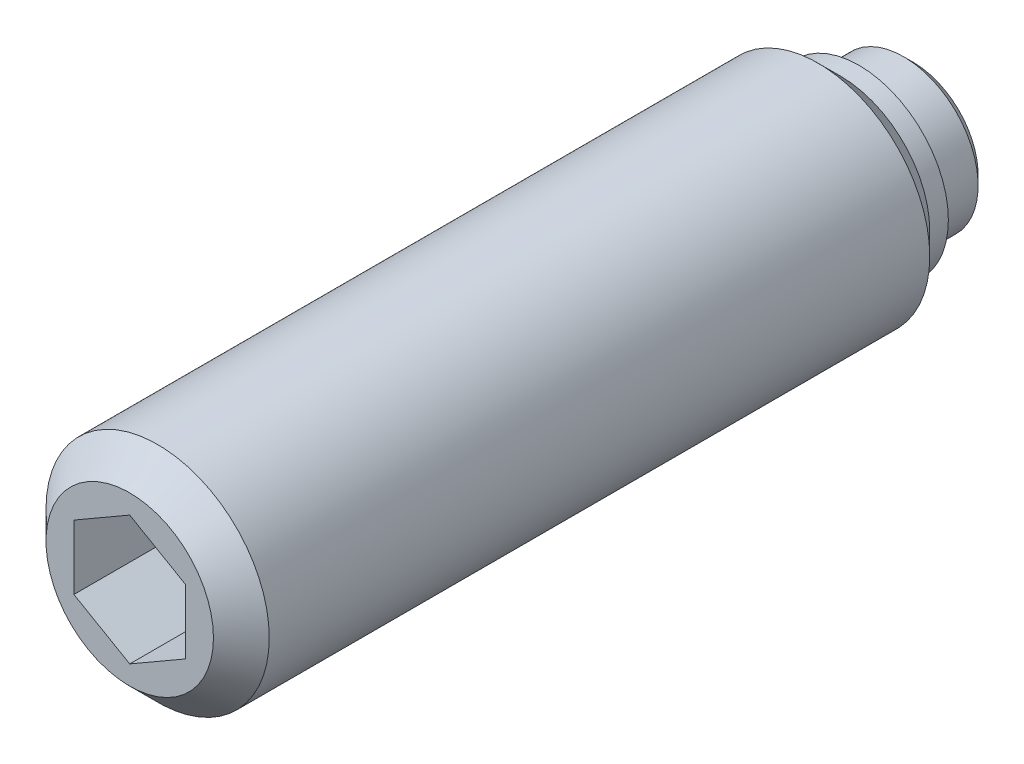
ISO-10303-21;
HEADER;
FILE_DESCRIPTION(('STEP AP214'),'2;1');
FILE_NAME('part.step','',(''),(''),'','','');
FILE_SCHEMA(('AUTOMOTIVE_DESIGN { 1 0 10303 214 1 1 1 1 }'));
ENDSEC;
DATA;
#1=APPLICATION_CONTEXT('core data for automotive mechanical design processes');
#2=APPLICATION_PROTOCOL_DEFINITION('international standard','automotive_design',2000,#1);
#3=PRODUCT_CONTEXT('',#1,'mechanical');
#4=PRODUCT('Part','Part','',(#3));
#5=PRODUCT_RELATED_PRODUCT_CATEGORY('part','',(#4));
#6=PRODUCT_DEFINITION_FORMATION('','',#4);
#7=PRODUCT_DEFINITION_CONTEXT('part definition',#1,'design');
#8=PRODUCT_DEFINITION('design','',#6,#7);
#9=PRODUCT_DEFINITION_SHAPE('','',#8);
#10=(LENGTH_UNIT() NAMED_UNIT(*) SI_UNIT(.MILLI.,.METRE.));
#11=(NAMED_UNIT(*) PLANE_ANGLE_UNIT() SI_UNIT($,.RADIAN.));
#12=(NAMED_UNIT(*) SI_UNIT($,.STERADIAN.) SOLID_ANGLE_UNIT());
#13=UNCERTAINTY_MEASURE_WITH_UNIT(LENGTH_MEASURE(1.E-05),#10,'distance_accuracy_value','');
#14=(GEOMETRIC_REPRESENTATION_CONTEXT(3) GLOBAL_UNCERTAINTY_ASSIGNED_CONTEXT((#13)) GLOBAL_UNIT_ASSIGNED_CONTEXT((#10,
#11,#12)) REPRESENTATION_CONTEXT('',''));
#15=CARTESIAN_POINT('',(0.,0.,0.));
#16=DIRECTION('',(0.,0.,1.));
#17=DIRECTION('',(1.,0.,0.));
#18=AXIS2_PLACEMENT_3D('',#15,#16,#17);
#19=CARTESIAN_POINT('',(0.,0.,0.));
#20=DIRECTION('',(0.,0.,-1.));
#21=DIRECTION('',(-1.,0.,0.));
#22=AXIS2_PLACEMENT_3D('',#19,#20,#21);
#23=CYLINDRICAL_SURFACE('',#22,4.);
#24=CARTESIAN_POINT('',(0.,0.,0.5));
#25=DIRECTION('',(0.,0.,-1.));
#26=DIRECTION('',(-1.,0.,0.));
#27=AXIS2_PLACEMENT_3D('',#24,#25,#26);
#28=CIRCLE('',#27,4.);
#29=CARTESIAN_POINT('',(-4.,0.,0.5));
#30=VERTEX_POINT('',#29);
#31=EDGE_CURVE('E133',#30,#30,#28,.T.);
#32=ORIENTED_EDGE('',*,*,#31,.F.);
#33=EDGE_LOOP('',(#32));
#34=FACE_BOUND('',#33,.T.);
#35=CARTESIAN_POINT('',(0.,0.,2.9));
#36=DIRECTION('',(0.,0.,-1.));
#37=DIRECTION('',(-1.,0.,0.));
#38=AXIS2_PLACEMENT_3D('',#35,#36,#37);
#39=CIRCLE('',#38,4.);
#40=CARTESIAN_POINT('',(-4.,0.,2.9));
#41=VERTEX_POINT('',#40);
#42=EDGE_CURVE('E127',#41,#41,#39,.T.);
#43=ORIENTED_EDGE('',*,*,#42,.T.);
#44=EDGE_LOOP('',(#43));
#45=FACE_BOUND('',#44,.T.);
#46=ADVANCED_FACE('F14',(#34,#45),#23,.T.);
#47=CARTESIAN_POINT('',(0.,0.,0.5));
#48=DIRECTION('',(0.,0.,1.));
#49=DIRECTION('',(1.,0.,0.));
#50=AXIS2_PLACEMENT_3D('',#47,#48,#49);
#51=CONICAL_SURFACE('',#50,4.,0.785398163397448);
#52=CARTESIAN_POINT('',(0.,0.,0.));
#53=DIRECTION('',(0.,0.,-1.));
#54=DIRECTION('',(-1.,0.,0.));
#55=AXIS2_PLACEMENT_3D('',#52,#53,#54);
#56=CIRCLE('',#55,3.5);
#57=CARTESIAN_POINT('',(-3.5,0.,0.));
#58=VERTEX_POINT('',#57);
#59=EDGE_CURVE('E130',#58,#58,#56,.T.);
#60=ORIENTED_EDGE('',*,*,#59,.F.);
#61=EDGE_LOOP('',(#60));
#62=FACE_BOUND('',#61,.T.);
#63=ORIENTED_EDGE('',*,*,#31,.T.);
#64=EDGE_LOOP('',(#63));
#65=FACE_BOUND('',#64,.T.);
#66=ADVANCED_FACE('F159',(#62,#65),#51,.T.);
#67=CARTESIAN_POINT('',(0.,3.5,0.));
#68=DIRECTION('',(0.,0.,1.));
#69=DIRECTION('',(1.,0.,0.));
#70=AXIS2_PLACEMENT_3D('',#67,#68,#69);
#71=PLANE('',#70);
#72=ORIENTED_EDGE('',*,*,#59,.T.);
#73=EDGE_LOOP('',(#72));
#74=FACE_BOUND('',#73,.T.);
#75=ADVANCED_FACE('F165',(#74),#71,.F.);
#76=CARTESIAN_POINT('',(0.,0.,2.9));
#77=DIRECTION('',(0.,0.,-1.));
#78=DIRECTION('',(-1.,0.,0.));
#79=AXIS2_PLACEMENT_3D('',#76,#77,#78);
#80=CYLINDRICAL_SURFACE('',#79,6.);
#81=CARTESIAN_POINT('',(0.,0.,5.1));
#82=DIRECTION('',(0.,0.,-1.));
#83=DIRECTION('',(-1.,0.,0.));
#84=AXIS2_PLACEMENT_3D('',#81,#82,#83);
#85=CIRCLE('',#84,6.);
#86=CARTESIAN_POINT('',(-6.,0.,5.1));
#87=VERTEX_POINT('',#86);
#88=EDGE_CURVE('E9',#87,#87,#85,.T.);
#89=ORIENTED_EDGE('',*,*,#88,.F.);
#90=EDGE_LOOP('',(#89));
#91=FACE_BOUND('',#90,.T.);
#92=CARTESIAN_POINT('',(0.,0.,40.6));
#93=DIRECTION('',(0.,0.,1.));
#94=DIRECTION('',(1.,0.,0.));
#95=AXIS2_PLACEMENT_3D('',#92,#93,#94);
#96=CIRCLE('',#95,6.);
#97=CARTESIAN_POINT('',(6.,0.,40.6));
#98=VERTEX_POINT('',#97);
#99=EDGE_CURVE('E124',#98,#98,#96,.T.);
#100=ORIENTED_EDGE('',*,*,#99,.F.);
#101=EDGE_LOOP('',(#100));
#102=FACE_BOUND('',#101,.T.);
#103=ADVANCED_FACE('F16',(#91,#102),#80,.T.);
#104=CARTESIAN_POINT('',(0.,4.8,2.9));
#105=DIRECTION('',(0.,0.,1.));
#106=DIRECTION('',(1.,0.,0.));
#107=AXIS2_PLACEMENT_3D('',#104,#105,#106);
#108=PLANE('',#107);
#109=CARTESIAN_POINT('',(0.,0.,2.9));
#110=DIRECTION('',(0.,0.,-1.));
#111=DIRECTION('',(-1.,0.,0.));
#112=AXIS2_PLACEMENT_3D('',#109,#110,#111);
#113=CIRCLE('',#112,4.8);
#114=CARTESIAN_POINT('',(-4.8,0.,2.9));
#115=VERTEX_POINT('',#114);
#116=EDGE_CURVE('E136',#115,#115,#113,.T.);
#117=ORIENTED_EDGE('',*,*,#116,.T.);
#118=EDGE_LOOP('',(#117));
#119=FACE_BOUND('',#118,.T.);
#120=ORIENTED_EDGE('',*,*,#42,.F.);
#121=EDGE_LOOP('',(#120));
#122=FACE_BOUND('',#121,.T.);
#123=ADVANCED_FACE('F156',(#119,#122),#108,.F.);
#124=CARTESIAN_POINT('',(0.,0.,2.9));
#125=DIRECTION('',(0.,0.,-1.));
#126=DIRECTION('',(-1.,0.,0.));
#127=AXIS2_PLACEMENT_3D('',#124,#125,#126);
#128=CYLINDRICAL_SURFACE('',#127,4.8);
#129=CARTESIAN_POINT('',(0.,0.,3.9));
#130=DIRECTION('',(0.,0.,-1.));
#131=DIRECTION('',(-1.,0.,0.));
#132=AXIS2_PLACEMENT_3D('',#129,#130,#131);
#133=CIRCLE('',#132,4.8);
#134=CARTESIAN_POINT('',(-4.8,0.,3.9));
#135=VERTEX_POINT('',#134);
#136=EDGE_CURVE('E22',#135,#135,#133,.T.);
#137=ORIENTED_EDGE('',*,*,#136,.T.);
#138=EDGE_LOOP('',(#137));
#139=FACE_BOUND('',#138,.T.);
#140=ORIENTED_EDGE('',*,*,#116,.F.);
#141=EDGE_LOOP('',(#140));
#142=FACE_BOUND('',#141,.T.);
#143=ADVANCED_FACE('F141',(#139,#142),#128,.T.);
#144=CARTESIAN_POINT('',(0.,0.,5.1));
#145=DIRECTION('',(0.,0.,1.));
#146=DIRECTION('',(1.,0.,0.));
#147=AXIS2_PLACEMENT_3D('',#144,#145,#146);
#148=CONICAL_SURFACE('',#147,6.,0.785398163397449);
#149=ORIENTED_EDGE('',*,*,#88,.T.);
#150=EDGE_LOOP('',(#149));
#151=FACE_BOUND('',#150,.T.);
#152=ORIENTED_EDGE('',*,*,#136,.F.);
#153=EDGE_LOOP('',(#152));
#154=FACE_BOUND('',#153,.T.);
#155=ADVANCED_FACE('F144',(#151,#154),#148,.T.);
#156=CARTESIAN_POINT('',(0.,-4.5,42.1));
#157=DIRECTION('',(0.,0.,1.));
#158=DIRECTION('',(1.,0.,0.));
#159=AXIS2_PLACEMENT_3D('',#156,#157,#158);
#160=PLANE('',#159);
#161=DIRECTION('',(0.866025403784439,-0.5,0.));
#162=VECTOR('',#161,1.);
#163=CARTESIAN_POINT('',(-3.,-1.73205080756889,42.1));
#164=LINE('',#163,#162);
#165=CARTESIAN_POINT('',(-3.,-1.73205080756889,42.1));
#166=VERTEX_POINT('',#165);
#167=CARTESIAN_POINT('',(0.,-3.46410161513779,42.1));
#168=VERTEX_POINT('',#167);
#169=EDGE_CURVE('E29',#166,#168,#164,.T.);
#170=ORIENTED_EDGE('',*,*,#169,.F.);
#171=DIRECTION('',(0.,-1.,0.));
#172=VECTOR('',#171,1.);
#173=CARTESIAN_POINT('',(-3.,1.73205080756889,42.1));
#174=LINE('',#173,#172);
#175=CARTESIAN_POINT('',(-3.,1.73205080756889,42.1));
#176=VERTEX_POINT('',#175);
#177=EDGE_CURVE('E112',#176,#166,#174,.T.);
#178=ORIENTED_EDGE('',*,*,#177,.F.);
#179=DIRECTION('',(-0.866025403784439,-0.5,0.));
#180=VECTOR('',#179,1.);
#181=CARTESIAN_POINT('',(0.,3.46410161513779,42.1));
#182=LINE('',#181,#180);
#183=CARTESIAN_POINT('',(0.,3.46410161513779,42.1));
#184=VERTEX_POINT('',#183);
#185=EDGE_CURVE('E110',#184,#176,#182,.T.);
#186=ORIENTED_EDGE('',*,*,#185,.F.);
#187=DIRECTION('',(-0.866025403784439,0.5,0.));
#188=VECTOR('',#187,1.);
#189=CARTESIAN_POINT('',(3.,1.73205080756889,42.1));
#190=LINE('',#189,#188);
#191=CARTESIAN_POINT('',(3.,1.73205080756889,42.1));
#192=VERTEX_POINT('',#191);
#193=EDGE_CURVE('E77',#192,#184,#190,.T.);
#194=ORIENTED_EDGE('',*,*,#193,.F.);
#195=DIRECTION('',(0.,1.,0.));
#196=VECTOR('',#195,1.);
#197=CARTESIAN_POINT('',(3.,-1.73205080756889,42.1));
#198=LINE('',#197,#196);
#199=CARTESIAN_POINT('',(3.,-1.73205080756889,42.1));
#200=VERTEX_POINT('',#199);
#201=EDGE_CURVE('E106',#200,#192,#198,.T.);
#202=ORIENTED_EDGE('',*,*,#201,.F.);
#203=DIRECTION('',(0.866025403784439,0.5,0.));
#204=VECTOR('',#203,1.);
#205=CARTESIAN_POINT('',(0.,-3.46410161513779,42.1));
#206=LINE('',#205,#204);
#207=EDGE_CURVE('E103',#168,#200,#206,.T.);
#208=ORIENTED_EDGE('',*,*,#207,.F.);
#209=EDGE_LOOP('',(#170,#178,#186,#194,#202,#208));
#210=FACE_BOUND('',#209,.T.);
#211=CARTESIAN_POINT('',(0.,0.,42.1));
#212=DIRECTION('',(0.,0.,1.));
#213=DIRECTION('',(1.,0.,0.));
#214=AXIS2_PLACEMENT_3D('',#211,#212,#213);
#215=CIRCLE('',#214,4.5);
#216=CARTESIAN_POINT('',(4.5,0.,42.1));
#217=VERTEX_POINT('',#216);
#218=EDGE_CURVE('E116',#217,#217,#215,.T.);
#219=ORIENTED_EDGE('',*,*,#218,.T.);
#220=EDGE_LOOP('',(#219));
#221=FACE_BOUND('',#220,.T.);
#222=ADVANCED_FACE('F146',(#210,#221),#160,.T.);
#223=CARTESIAN_POINT('',(0.,0.,42.1));
#224=DIRECTION('',(0.,0.,-1.));
#225=DIRECTION('',(-1.,0.,0.));
#226=AXIS2_PLACEMENT_3D('',#223,#224,#225);
#227=CONICAL_SURFACE('',#226,4.5,0.785398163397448);
#228=ORIENTED_EDGE('',*,*,#99,.T.);
#229=EDGE_LOOP('',(#228));
#230=FACE_BOUND('',#229,.T.);
#231=ORIENTED_EDGE('',*,*,#218,.F.);
#232=EDGE_LOOP('',(#231));
#233=FACE_BOUND('',#232,.T.);
#234=ADVANCED_FACE('F153',(#230,#233),#227,.T.);
#235=CARTESIAN_POINT('',(-3.,-1.73205080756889,34.1));
#236=DIRECTION('',(-0.5,-0.866025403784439,0.));
#237=DIRECTION('',(0.866025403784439,-0.5,0.));
#238=AXIS2_PLACEMENT_3D('',#235,#236,#237);
#239=PLANE('',#238);
#240=ORIENTED_EDGE('',*,*,#169,.T.);
#241=DIRECTION('',(0.,0.,1.));
#242=VECTOR('',#241,1.);
#243=CARTESIAN_POINT('',(0.,-3.46410161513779,34.1));
#244=LINE('',#243,#242);
#245=CARTESIAN_POINT('',(0.,-3.46410161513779,34.1));
#246=VERTEX_POINT('',#245);
#247=EDGE_CURVE('E59',#246,#168,#244,.T.);
#248=ORIENTED_EDGE('',*,*,#247,.F.);
#249=DIRECTION('',(0.866025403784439,-0.5,0.));
#250=VECTOR('',#249,1.);
#251=CARTESIAN_POINT('',(-3.,-1.73205080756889,34.1));
#252=LINE('',#251,#250);
#253=CARTESIAN_POINT('',(-3.,-1.73205080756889,34.1));
#254=VERTEX_POINT('',#253);
#255=EDGE_CURVE('E114',#254,#246,#252,.T.);
#256=ORIENTED_EDGE('',*,*,#255,.F.);
#257=DIRECTION('',(0.,0.,1.));
#258=VECTOR('',#257,1.);
#259=CARTESIAN_POINT('',(-3.,-1.73205080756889,34.1));
#260=LINE('',#259,#258);
#261=EDGE_CURVE('E37',#254,#166,#260,.T.);
#262=ORIENTED_EDGE('',*,*,#261,.T.);
#263=EDGE_LOOP('',(#240,#248,#256,#262));
#264=FACE_BOUND('',#263,.T.);
#265=ADVANCED_FACE('F191',(#264),#239,.F.);
#266=CARTESIAN_POINT('',(-3.,1.73205080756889,34.1));
#267=DIRECTION('',(-1.,0.,0.));
#268=DIRECTION('',(0.,0.,1.));
#269=AXIS2_PLACEMENT_3D('',#266,#267,#268);
#270=PLANE('',#269);
#271=ORIENTED_EDGE('',*,*,#177,.T.);
#272=ORIENTED_EDGE('',*,*,#261,.F.);
#273=DIRECTION('',(0.,-1.,0.));
#274=VECTOR('',#273,1.);
#275=CARTESIAN_POINT('',(-3.,1.73205080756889,34.1));
#276=LINE('',#275,#274);
#277=CARTESIAN_POINT('',(-3.,1.73205080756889,34.1));
#278=VERTEX_POINT('',#277);
#279=EDGE_CURVE('E89',#278,#254,#276,.T.);
#280=ORIENTED_EDGE('',*,*,#279,.F.);
#281=DIRECTION('',(0.,0.,1.));
#282=VECTOR('',#281,1.);
#283=CARTESIAN_POINT('',(-3.,1.73205080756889,34.1));
#284=LINE('',#283,#282);
#285=EDGE_CURVE('E81',#278,#176,#284,.T.);
#286=ORIENTED_EDGE('',*,*,#285,.T.);
#287=EDGE_LOOP('',(#271,#272,#280,#286));
#288=FACE_BOUND('',#287,.T.);
#289=ADVANCED_FACE('F198',(#288),#270,.F.);
#290=CARTESIAN_POINT('',(0.,3.46410161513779,34.1));
#291=DIRECTION('',(-0.5,0.866025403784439,0.));
#292=DIRECTION('',(-0.866025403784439,-0.5,0.));
#293=AXIS2_PLACEMENT_3D('',#290,#291,#292);
#294=PLANE('',#293);
#295=ORIENTED_EDGE('',*,*,#185,.T.);
#296=ORIENTED_EDGE('',*,*,#285,.F.);
#297=DIRECTION('',(-0.866025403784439,-0.5,0.));
#298=VECTOR('',#297,1.);
#299=CARTESIAN_POINT('',(0.,3.46410161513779,34.1));
#300=LINE('',#299,#298);
#301=CARTESIAN_POINT('',(0.,3.46410161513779,34.1));
#302=VERTEX_POINT('',#301);
#303=EDGE_CURVE('E85',#302,#278,#300,.T.);
#304=ORIENTED_EDGE('',*,*,#303,.F.);
#305=DIRECTION('',(0.,0.,1.));
#306=VECTOR('',#305,1.);
#307=CARTESIAN_POINT('',(0.,3.46410161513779,34.1));
#308=LINE('',#307,#306);
#309=EDGE_CURVE('E70',#302,#184,#308,.T.);
#310=ORIENTED_EDGE('',*,*,#309,.T.);
#311=EDGE_LOOP('',(#295,#296,#304,#310));
#312=FACE_BOUND('',#311,.T.);
#313=ADVANCED_FACE('F86',(#312),#294,.F.);
#314=CARTESIAN_POINT('',(3.,1.73205080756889,34.1));
#315=DIRECTION('',(0.5,0.866025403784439,0.));
#316=DIRECTION('',(-0.866025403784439,0.5,0.));
#317=AXIS2_PLACEMENT_3D('',#314,#315,#316);
#318=PLANE('',#317);
#319=ORIENTED_EDGE('',*,*,#193,.T.);
#320=ORIENTED_EDGE('',*,*,#309,.F.);
#321=DIRECTION('',(-0.866025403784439,0.5,0.));
#322=VECTOR('',#321,1.);
#323=CARTESIAN_POINT('',(3.,1.73205080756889,34.1));
#324=LINE('',#323,#322);
#325=CARTESIAN_POINT('',(3.,1.73205080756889,34.1));
#326=VERTEX_POINT('',#325);
#327=EDGE_CURVE('E74',#326,#302,#324,.T.);
#328=ORIENTED_EDGE('',*,*,#327,.F.);
#329=DIRECTION('',(0.,0.,1.));
#330=VECTOR('',#329,1.);
#331=CARTESIAN_POINT('',(3.,1.73205080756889,34.1));
#332=LINE('',#331,#330);
#333=EDGE_CURVE('E82',#326,#192,#332,.T.);
#334=ORIENTED_EDGE('',*,*,#333,.T.);
#335=EDGE_LOOP('',(#319,#320,#328,#334));
#336=FACE_BOUND('',#335,.T.);
#337=ADVANCED_FACE('F72',(#336),#318,.F.);
#338=CARTESIAN_POINT('',(3.,-1.73205080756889,34.1));
#339=DIRECTION('',(1.,0.,0.));
#340=DIRECTION('',(0.,0.,-1.));
#341=AXIS2_PLACEMENT_3D('',#338,#339,#340);
#342=PLANE('',#341);
#343=ORIENTED_EDGE('',*,*,#201,.T.);
#344=ORIENTED_EDGE('',*,*,#333,.F.);
#345=DIRECTION('',(0.,1.,0.));
#346=VECTOR('',#345,1.);
#347=CARTESIAN_POINT('',(3.,-1.73205080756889,34.1));
#348=LINE('',#347,#346);
#349=CARTESIAN_POINT('',(3.,-1.73205080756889,34.1));
#350=VERTEX_POINT('',#349);
#351=EDGE_CURVE('E95',#350,#326,#348,.T.);
#352=ORIENTED_EDGE('',*,*,#351,.F.);
#353=DIRECTION('',(0.,0.,1.));
#354=VECTOR('',#353,1.);
#355=CARTESIAN_POINT('',(3.,-1.73205080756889,34.1));
#356=LINE('',#355,#354);
#357=EDGE_CURVE('E119',#350,#200,#356,.T.);
#358=ORIENTED_EDGE('',*,*,#357,.T.);
#359=EDGE_LOOP('',(#343,#344,#352,#358));
#360=FACE_BOUND('',#359,.T.);
#361=ADVANCED_FACE('F204',(#360),#342,.F.);
#362=CARTESIAN_POINT('',(0.,-3.46410161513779,34.1));
#363=DIRECTION('',(0.5,-0.866025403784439,0.));
#364=DIRECTION('',(0.866025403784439,0.5,0.));
#365=AXIS2_PLACEMENT_3D('',#362,#363,#364);
#366=PLANE('',#365);
#367=ORIENTED_EDGE('',*,*,#207,.T.);
#368=ORIENTED_EDGE('',*,*,#357,.F.);
#369=DIRECTION('',(0.866025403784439,0.5,0.));
#370=VECTOR('',#369,1.);
#371=CARTESIAN_POINT('',(0.,-3.46410161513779,34.1));
#372=LINE('',#371,#370);
#373=EDGE_CURVE('E97',#246,#350,#372,.T.);
#374=ORIENTED_EDGE('',*,*,#373,.F.);
#375=ORIENTED_EDGE('',*,*,#247,.T.);
#376=EDGE_LOOP('',(#367,#368,#374,#375));
#377=FACE_BOUND('',#376,.T.);
#378=ADVANCED_FACE('F201',(#377),#366,.F.);
#379=CARTESIAN_POINT('',(0.,0.,34.1));
#380=DIRECTION('',(0.,0.,1.));
#381=DIRECTION('',(1.,0.,0.));
#382=AXIS2_PLACEMENT_3D('',#379,#380,#381);
#383=PLANE('',#382);
#384=ORIENTED_EDGE('',*,*,#255,.T.);
#385=ORIENTED_EDGE('',*,*,#373,.T.);
#386=ORIENTED_EDGE('',*,*,#351,.T.);
#387=ORIENTED_EDGE('',*,*,#327,.T.);
#388=ORIENTED_EDGE('',*,*,#303,.T.);
#389=ORIENTED_EDGE('',*,*,#279,.T.);
#390=EDGE_LOOP('',(#384,#385,#386,#387,#388,#389));
#391=FACE_BOUND('',#390,.T.);
#392=ADVANCED_FACE('F92',(#391),#383,.T.);
#393=CLOSED_SHELL('',(#46,#66,#75,#103,#123,#143,#155,#222,#234,#265,#289,#313,#337,#361,#378,#392));
#394=MANIFOLD_SOLID_BREP('B1',#393);
#395=ADVANCED_BREP_SHAPE_REPRESENTATION('',(#18,#394),#14);
#396=SHAPE_DEFINITION_REPRESENTATION(#9,#395);
ENDSEC;
END-ISO-10303-21;
